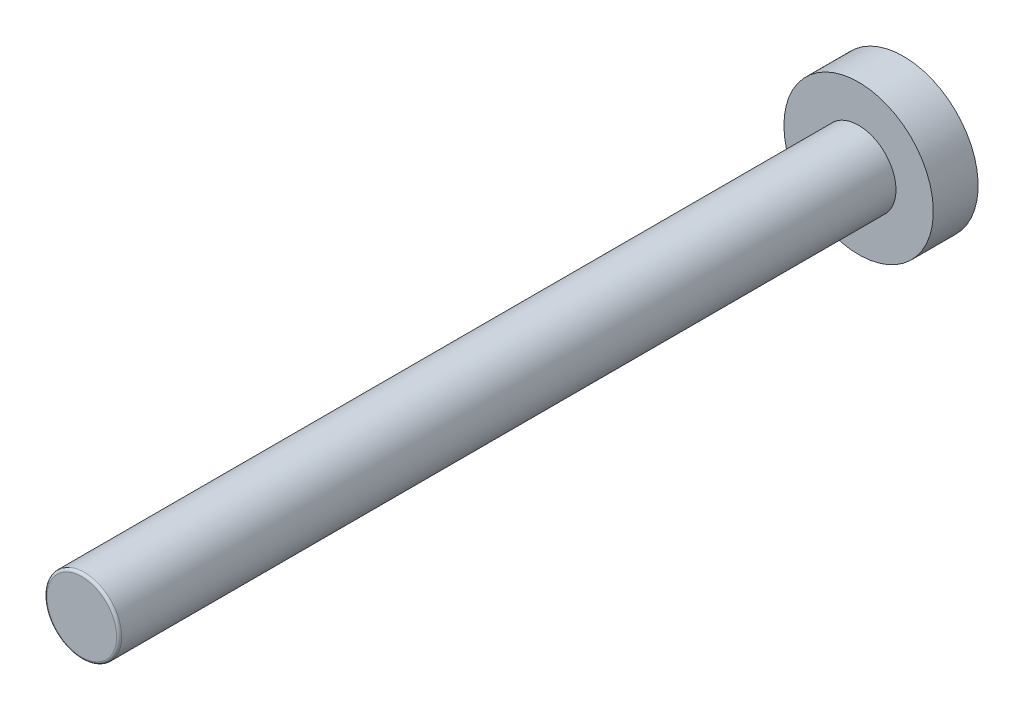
ISO-10303-21;
HEADER;
FILE_DESCRIPTION(('STEP AP214'),'2;1');
FILE_NAME('part.step','',(''),(''),'','','');
FILE_SCHEMA(('AUTOMOTIVE_DESIGN { 1 0 10303 214 1 1 1 1 }'));
ENDSEC;
DATA;
#1=APPLICATION_CONTEXT('core data for automotive mechanical design processes');
#2=APPLICATION_PROTOCOL_DEFINITION('international standard','automotive_design',2000,#1);
#3=PRODUCT_CONTEXT('',#1,'mechanical');
#4=PRODUCT('Part','Part','',(#3));
#5=PRODUCT_RELATED_PRODUCT_CATEGORY('part','',(#4));
#6=PRODUCT_DEFINITION_FORMATION('','',#4);
#7=PRODUCT_DEFINITION_CONTEXT('part definition',#1,'design');
#8=PRODUCT_DEFINITION('design','',#6,#7);
#9=PRODUCT_DEFINITION_SHAPE('','',#8);
#10=(LENGTH_UNIT() NAMED_UNIT(*) SI_UNIT(.MILLI.,.METRE.));
#11=(NAMED_UNIT(*) PLANE_ANGLE_UNIT() SI_UNIT($,.RADIAN.));
#12=(NAMED_UNIT(*) SI_UNIT($,.STERADIAN.) SOLID_ANGLE_UNIT());
#13=UNCERTAINTY_MEASURE_WITH_UNIT(LENGTH_MEASURE(1.E-05),#10,'distance_accuracy_value','');
#14=(GEOMETRIC_REPRESENTATION_CONTEXT(3) GLOBAL_UNCERTAINTY_ASSIGNED_CONTEXT((#13)) GLOBAL_UNIT_ASSIGNED_CONTEXT((#10,
#11,#12)) REPRESENTATION_CONTEXT('',''));
#15=CARTESIAN_POINT('',(0.,0.,0.));
#16=DIRECTION('',(0.,0.,1.));
#17=DIRECTION('',(1.,0.,0.));
#18=AXIS2_PLACEMENT_3D('',#15,#16,#17);
#19=CARTESIAN_POINT('',(0.,0.,-0.00210827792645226));
#20=DIRECTION('',(0.,0.,1.));
#21=DIRECTION('',(1.,0.,0.));
#22=AXIS2_PLACEMENT_3D('',#19,#20,#21);
#23=CYLINDRICAL_SURFACE('',#22,2.5);
#24=CARTESIAN_POINT('',(0.,0.,55.1702786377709));
#25=DIRECTION('',(0.,0.,1.));
#26=DIRECTION('',(1.,0.,0.));
#27=AXIS2_PLACEMENT_3D('',#24,#25,#26);
#28=CIRCLE('',#27,2.5);
#29=CARTESIAN_POINT('',(2.50000000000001,0.,55.1702786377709));
#30=VERTEX_POINT('',#29);
#31=EDGE_CURVE('E43',#30,#30,#28,.T.);
#32=ORIENTED_EDGE('',*,*,#31,.F.);
#33=EDGE_LOOP('',(#32));
#34=FACE_BOUND('',#33,.T.);
#35=CARTESIAN_POINT('',(0.,0.,3.34055727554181));
#36=DIRECTION('',(0.,0.,-1.));
#37=DIRECTION('',(-1.,0.,0.));
#38=AXIS2_PLACEMENT_3D('',#35,#36,#37);
#39=CIRCLE('',#38,2.5);
#40=CARTESIAN_POINT('',(-2.5,0.,3.34055727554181));
#41=VERTEX_POINT('',#40);
#42=EDGE_CURVE('E39',#41,#41,#39,.F.);
#43=ORIENTED_EDGE('',*,*,#42,.T.);
#44=EDGE_LOOP('',(#43));
#45=FACE_BOUND('',#44,.T.);
#46=ADVANCED_FACE('F35',(#34,#45),#23,.T.);
#47=CARTESIAN_POINT('',(0.,0.,55.3405572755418));
#48=DIRECTION('',(0.,0.,1.));
#49=DIRECTION('',(1.,0.,0.));
#50=AXIS2_PLACEMENT_3D('',#47,#48,#49);
#51=PLANE('',#50);
#52=CARTESIAN_POINT('',(0.,0.,55.3405572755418));
#53=DIRECTION('',(0.,0.,1.));
#54=DIRECTION('',(1.,0.,0.));
#55=AXIS2_PLACEMENT_3D('',#52,#53,#54);
#56=CIRCLE('',#55,2.3297213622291);
#57=CARTESIAN_POINT('',(2.32972136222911,0.,55.3405572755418));
#58=VERTEX_POINT('',#57);
#59=EDGE_CURVE('E10',#58,#58,#56,.T.);
#60=ORIENTED_EDGE('',*,*,#59,.T.);
#61=EDGE_LOOP('',(#60));
#62=FACE_BOUND('',#61,.T.);
#63=ADVANCED_FACE('F73',(#62),#51,.T.);
#64=CARTESIAN_POINT('',(0.,0.,55.1702786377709));
#65=DIRECTION('',(0.,0.,1.));
#66=DIRECTION('',(1.,0.,0.));
#67=AXIS2_PLACEMENT_3D('',#64,#65,#66);
#68=TOROIDAL_SURFACE('',#67,2.3297213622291,0.1702786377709);
#69=ORIENTED_EDGE('',*,*,#31,.T.);
#70=EDGE_LOOP('',(#69));
#71=FACE_BOUND('',#70,.T.);
#72=ORIENTED_EDGE('',*,*,#59,.F.);
#73=EDGE_LOOP('',(#72));
#74=FACE_BOUND('',#73,.T.);
#75=ADVANCED_FACE('F70',(#71,#74),#68,.T.);
#76=CARTESIAN_POINT('',(0.,0.,3.34055727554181));
#77=DIRECTION('',(0.,0.,-1.));
#78=DIRECTION('',(-1.,0.,0.));
#79=AXIS2_PLACEMENT_3D('',#76,#77,#78);
#80=CYLINDRICAL_SURFACE('',#79,5.);
#81=CARTESIAN_POINT('',(0.,0.,3.34055727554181));
#82=DIRECTION('',(0.,0.,-1.));
#83=DIRECTION('',(-1.,0.,0.));
#84=AXIS2_PLACEMENT_3D('',#81,#82,#83);
#85=CIRCLE('',#84,5.);
#86=CARTESIAN_POINT('',(-5.,0.,3.34055727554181));
#87=VERTEX_POINT('',#86);
#88=EDGE_CURVE('E52',#87,#87,#85,.T.);
#89=ORIENTED_EDGE('',*,*,#88,.T.);
#90=EDGE_LOOP('',(#89));
#91=FACE_BOUND('',#90,.T.);
#92=CARTESIAN_POINT('',(0.,0.,0.34055727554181));
#93=DIRECTION('',(0.,0.,-1.));
#94=DIRECTION('',(-1.,0.,0.));
#95=AXIS2_PLACEMENT_3D('',#92,#93,#94);
#96=CIRCLE('',#95,5.);
#97=CARTESIAN_POINT('',(-5.,0.,0.34055727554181));
#98=VERTEX_POINT('',#97);
#99=EDGE_CURVE('E49',#98,#98,#96,.T.);
#100=ORIENTED_EDGE('',*,*,#99,.F.);
#101=EDGE_LOOP('',(#100));
#102=FACE_BOUND('',#101,.T.);
#103=ADVANCED_FACE('F63',(#91,#102),#80,.T.);
#104=CARTESIAN_POINT('',(0.,0.,3.34055727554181));
#105=DIRECTION('',(0.,0.,-1.));
#106=DIRECTION('',(-1.,0.,0.));
#107=AXIS2_PLACEMENT_3D('',#104,#105,#106);
#108=PLANE('',#107);
#109=ORIENTED_EDGE('',*,*,#42,.F.);
#110=EDGE_LOOP('',(#109));
#111=FACE_BOUND('',#110,.T.);
#112=ORIENTED_EDGE('',*,*,#88,.F.);
#113=EDGE_LOOP('',(#112));
#114=FACE_BOUND('',#113,.T.);
#115=ADVANCED_FACE('F60',(#111,#114),#108,.F.);
#116=CARTESIAN_POINT('',(2.32972136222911,0.,0.34055727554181));
#117=DIRECTION('',(0.,0.,-1.));
#118=DIRECTION('',(-1.,0.,0.));
#119=AXIS2_PLACEMENT_3D('',#116,#117,#118);
#120=PLANE('',#119);
#121=ORIENTED_EDGE('',*,*,#99,.T.);
#122=EDGE_LOOP('',(#121));
#123=FACE_BOUND('',#122,.T.);
#124=ADVANCED_FACE('F37',(#123),#120,.T.);
#125=CLOSED_SHELL('',(#46,#63,#75,#103,#115,#124));
#126=MANIFOLD_SOLID_BREP('B2',#125);
#127=ADVANCED_BREP_SHAPE_REPRESENTATION('',(#18,#126),#14);
#128=SHAPE_DEFINITION_REPRESENTATION(#9,#127);
ENDSEC;
END-ISO-10303-21;
